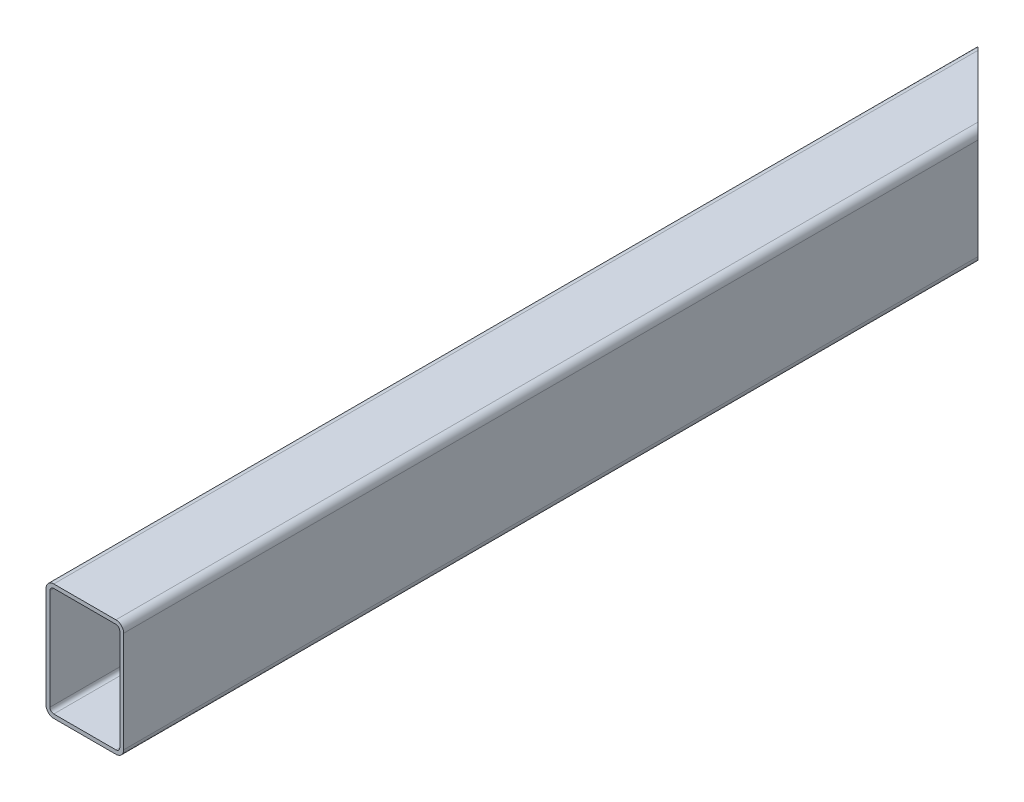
from build123d import *

# Parameters (mm, degrees)
BASE_EXTRU_MINCE_DEPTH  = 240
ENL_V_MAT_EXTRU_1_DEPTH = 60


with BuildPart() as part:
    # Esquisse1 → Base-Extru.-Mince (new, symmetric)
    with BuildSketch(Plane.XY):
        with BuildLine():
            Line((16, 30), (-16, 30))
            ThreePointArc((-16, 30), (-18.828427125, 28.828427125), (-20, 26))
            Line((-20, 26), (-20, -26))
            ThreePointArc((-20, -26), (-18.828427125, -28.828427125), (-16, -30))
            Line((-16, -30), (16, -30))
            ThreePointArc((16, -30), (18.828427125, -28.828427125), (20, -26))
            Line((20, -26), (20, 26))
            ThreePointArc((20, 26), (18.828427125, 28.828427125), (16, 30))
        make_face()
        with BuildLine():
            Line((16, 28), (-16, 28))
            ThreePointArc((-16, 28), (-17.414213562, 27.414213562), (-18, 26))
            Line((-18, 26), (-18, -26))
            ThreePointArc((-18, -26), (-17.414213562, -27.414213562), (-16, -28))
            Line((-16, -28), (16, -28))
            ThreePointArc((16, -28), (17.414213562, -27.414213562), (18, -26))
            Line((18, -26), (18, 26))
            ThreePointArc((18, 26), (17.414213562, 27.414213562), (16, 28))
        make_face(mode=Mode.SUBTRACT)
    extrude(amount=BASE_EXTRU_MINCE_DEPTH, both=True)

    # Esquisse2 → Enl_v. mat.-Extru.1 (cut)
    with BuildSketch(Plane(origin=(0, 30, 0), x_dir=(-1, 0, 0), z_dir=(0, 1, 0))):
        Polygon((20, -240), (-20, -200), (-20, -240), align=None)
    extrude(amount=-ENL_V_MAT_EXTRU_1_DEPTH, mode=Mode.SUBTRACT)


solid = part.part
